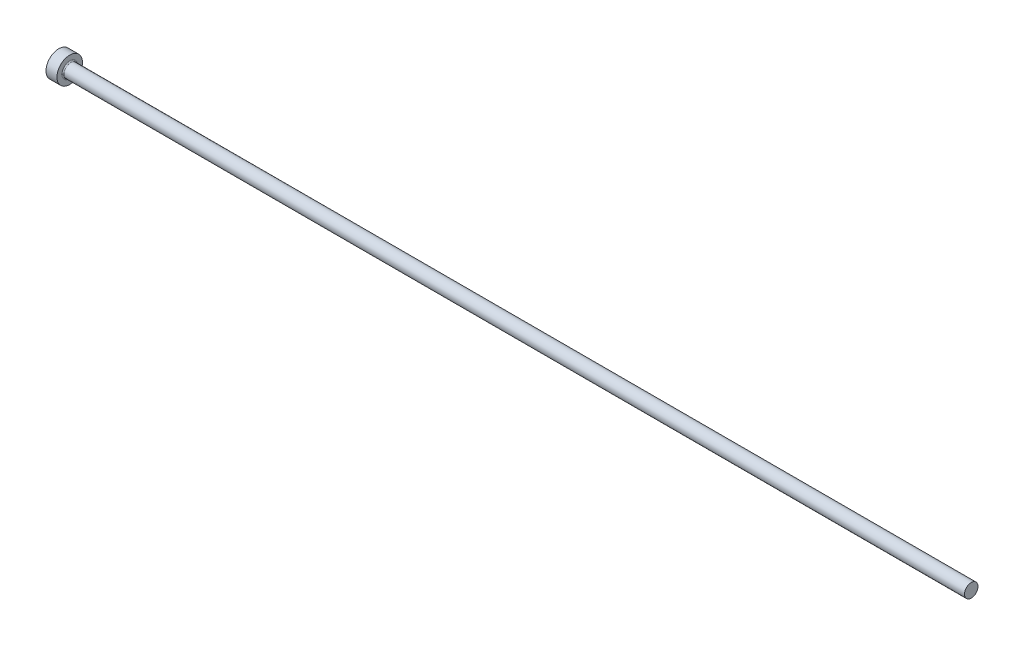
ISO-10303-21;
HEADER;
FILE_DESCRIPTION(('STEP AP214'),'2;1');
FILE_NAME('part.step','',(''),(''),'','','');
FILE_SCHEMA(('AUTOMOTIVE_DESIGN { 1 0 10303 214 1 1 1 1 }'));
ENDSEC;
DATA;
#1=APPLICATION_CONTEXT('core data for automotive mechanical design processes');
#2=APPLICATION_PROTOCOL_DEFINITION('international standard','automotive_design',2000,#1);
#3=PRODUCT_CONTEXT('',#1,'mechanical');
#4=PRODUCT('Part','Part','',(#3));
#5=PRODUCT_RELATED_PRODUCT_CATEGORY('part','',(#4));
#6=PRODUCT_DEFINITION_FORMATION('','',#4);
#7=PRODUCT_DEFINITION_CONTEXT('part definition',#1,'design');
#8=PRODUCT_DEFINITION('design','',#6,#7);
#9=PRODUCT_DEFINITION_SHAPE('','',#8);
#10=(LENGTH_UNIT() NAMED_UNIT(*) SI_UNIT(.MILLI.,.METRE.));
#11=(NAMED_UNIT(*) PLANE_ANGLE_UNIT() SI_UNIT($,.RADIAN.));
#12=(NAMED_UNIT(*) SI_UNIT($,.STERADIAN.) SOLID_ANGLE_UNIT());
#13=UNCERTAINTY_MEASURE_WITH_UNIT(LENGTH_MEASURE(1.E-05),#10,'distance_accuracy_value','');
#14=(GEOMETRIC_REPRESENTATION_CONTEXT(3) GLOBAL_UNCERTAINTY_ASSIGNED_CONTEXT((#13)) GLOBAL_UNIT_ASSIGNED_CONTEXT((#10,
#11,#12)) REPRESENTATION_CONTEXT('',''));
#15=CARTESIAN_POINT('',(0.,0.,0.));
#16=DIRECTION('',(0.,0.,1.));
#17=DIRECTION('',(1.,0.,0.));
#18=AXIS2_PLACEMENT_3D('',#15,#16,#17);
#19=CARTESIAN_POINT('',(0.,0.,0.));
#20=DIRECTION('',(-1.,0.,0.));
#21=DIRECTION('',(0.,-1.,0.));
#22=AXIS2_PLACEMENT_3D('',#19,#20,#21);
#23=PLANE('',#22);
#24=CARTESIAN_POINT('',(0.,0.,0.));
#25=DIRECTION('',(1.,0.,0.));
#26=DIRECTION('',(0.,1.,0.));
#27=AXIS2_PLACEMENT_3D('',#24,#25,#26);
#28=CIRCLE('',#27,3.5);
#29=CARTESIAN_POINT('',(0.,3.5,0.));
#30=VERTEX_POINT('',#29);
#31=EDGE_CURVE('E25',#30,#30,#28,.T.);
#32=ORIENTED_EDGE('',*,*,#31,.F.);
#33=EDGE_LOOP('',(#32));
#34=FACE_BOUND('',#33,.T.);
#35=ADVANCED_FACE('F14',(#34),#23,.T.);
#36=CARTESIAN_POINT('',(250.,0.,0.));
#37=DIRECTION('',(1.,0.,0.));
#38=DIRECTION('',(0.,1.,0.));
#39=AXIS2_PLACEMENT_3D('',#36,#37,#38);
#40=CYLINDRICAL_SURFACE('',#39,3.5);
#41=ORIENTED_EDGE('',*,*,#31,.T.);
#42=EDGE_LOOP('',(#41));
#43=FACE_BOUND('',#42,.T.);
#44=CARTESIAN_POINT('',(3.,0.,0.));
#45=DIRECTION('',(1.,0.,0.));
#46=DIRECTION('',(0.,1.,0.));
#47=AXIS2_PLACEMENT_3D('',#44,#45,#46);
#48=CIRCLE('',#47,3.5);
#49=CARTESIAN_POINT('',(3.,3.5,0.));
#50=VERTEX_POINT('',#49);
#51=EDGE_CURVE('E29',#50,#50,#48,.T.);
#52=ORIENTED_EDGE('',*,*,#51,.F.);
#53=EDGE_LOOP('',(#52));
#54=FACE_BOUND('',#53,.T.);
#55=ADVANCED_FACE('F51',(#43,#54),#40,.T.);
#56=CARTESIAN_POINT('',(3.,3.5,0.));
#57=DIRECTION('',(1.,0.,0.));
#58=DIRECTION('',(0.,1.,0.));
#59=AXIS2_PLACEMENT_3D('',#56,#57,#58);
#60=PLANE('',#59);
#61=CARTESIAN_POINT('',(3.,0.,0.));
#62=DIRECTION('',(1.,0.,0.));
#63=DIRECTION('',(0.,1.,0.));
#64=AXIS2_PLACEMENT_3D('',#61,#62,#63);
#65=CIRCLE('',#64,2.14999999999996);
#66=CARTESIAN_POINT('',(3.,2.14999999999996,0.));
#67=VERTEX_POINT('',#66);
#68=EDGE_CURVE('E9',#67,#67,#65,.F.);
#69=ORIENTED_EDGE('',*,*,#68,.T.);
#70=EDGE_LOOP('',(#69));
#71=FACE_BOUND('',#70,.T.);
#72=ORIENTED_EDGE('',*,*,#51,.T.);
#73=EDGE_LOOP('',(#72));
#74=FACE_BOUND('',#73,.T.);
#75=ADVANCED_FACE('F42',(#71,#74),#60,.T.);
#76=CARTESIAN_POINT('',(250.,0.,0.));
#77=DIRECTION('',(1.,0.,0.));
#78=DIRECTION('',(0.,1.,0.));
#79=AXIS2_PLACEMENT_3D('',#76,#77,#78);
#80=CYLINDRICAL_SURFACE('',#79,1.84999999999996);
#81=CARTESIAN_POINT('',(3.3,0.,0.));
#82=DIRECTION('',(1.,0.,0.));
#83=DIRECTION('',(0.,1.,0.));
#84=AXIS2_PLACEMENT_3D('',#81,#82,#83);
#85=CIRCLE('',#84,1.84999999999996);
#86=CARTESIAN_POINT('',(3.3,1.84999999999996,0.));
#87=VERTEX_POINT('',#86);
#88=EDGE_CURVE('E21',#87,#87,#85,.T.);
#89=ORIENTED_EDGE('',*,*,#88,.T.);
#90=EDGE_LOOP('',(#89));
#91=FACE_BOUND('',#90,.T.);
#92=CARTESIAN_POINT('',(250.,0.,0.));
#93=DIRECTION('',(1.,0.,0.));
#94=DIRECTION('',(0.,1.,0.));
#95=AXIS2_PLACEMENT_3D('',#92,#93,#94);
#96=CIRCLE('',#95,1.84999999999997);
#97=CARTESIAN_POINT('',(250.,1.84999999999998,0.));
#98=VERTEX_POINT('',#97);
#99=EDGE_CURVE('E34',#98,#98,#96,.T.);
#100=ORIENTED_EDGE('',*,*,#99,.F.);
#101=EDGE_LOOP('',(#100));
#102=FACE_BOUND('',#101,.T.);
#103=ADVANCED_FACE('F40',(#91,#102),#80,.T.);
#104=CARTESIAN_POINT('',(250.,1.84999999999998,0.));
#105=DIRECTION('',(1.,0.,0.));
#106=DIRECTION('',(0.,1.,0.));
#107=AXIS2_PLACEMENT_3D('',#104,#105,#106);
#108=PLANE('',#107);
#109=ORIENTED_EDGE('',*,*,#99,.T.);
#110=EDGE_LOOP('',(#109));
#111=FACE_BOUND('',#110,.T.);
#112=ADVANCED_FACE('F38',(#111),#108,.T.);
#113=CARTESIAN_POINT('',(3.3,0.,0.));
#114=DIRECTION('',(1.,0.,0.));
#115=DIRECTION('',(0.,1.,0.));
#116=AXIS2_PLACEMENT_3D('',#113,#114,#115);
#117=TOROIDAL_SURFACE('',#116,2.14999999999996,0.3);
#118=ORIENTED_EDGE('',*,*,#68,.F.);
#119=EDGE_LOOP('',(#118));
#120=FACE_BOUND('',#119,.T.);
#121=ORIENTED_EDGE('',*,*,#88,.F.);
#122=EDGE_LOOP('',(#121));
#123=FACE_BOUND('',#122,.T.);
#124=ADVANCED_FACE('F16',(#120,#123),#117,.F.);
#125=CLOSED_SHELL('',(#35,#55,#75,#103,#112,#124));
#126=MANIFOLD_SOLID_BREP('B1',#125);
#127=ADVANCED_BREP_SHAPE_REPRESENTATION('',(#18,#126),#14);
#128=SHAPE_DEFINITION_REPRESENTATION(#9,#127);
ENDSEC;
END-ISO-10303-21;
